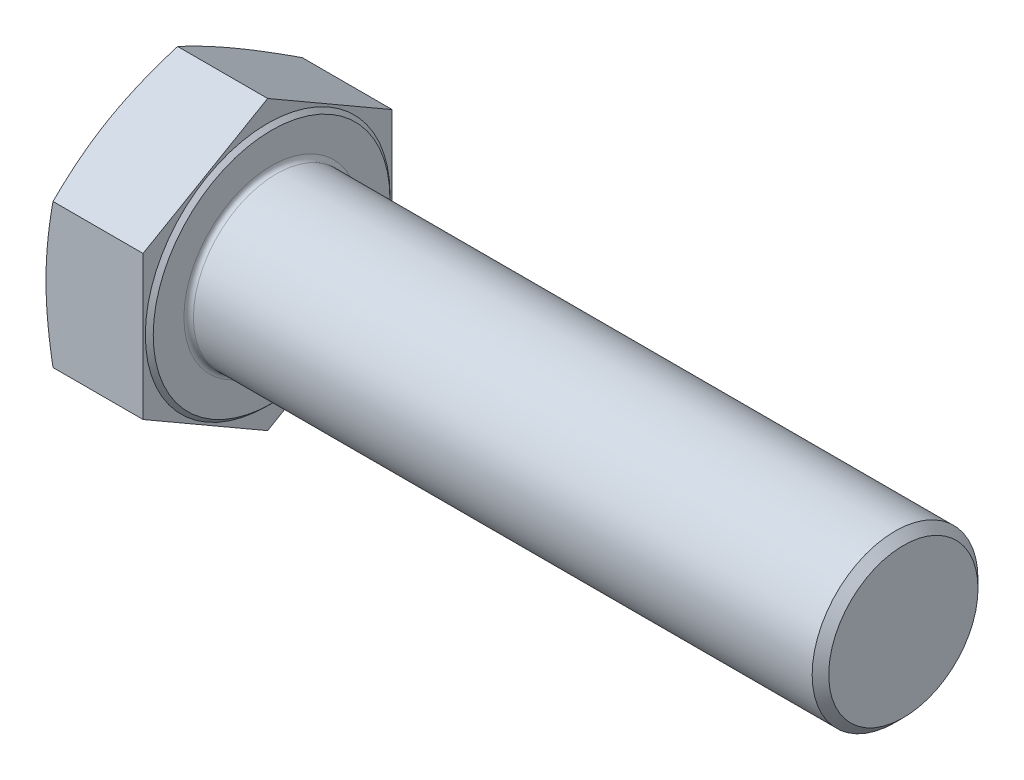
ISO-10303-21;
HEADER;
FILE_DESCRIPTION(('STEP AP214'),'2;1');
FILE_NAME('part.step','',(''),(''),'','','');
FILE_SCHEMA(('AUTOMOTIVE_DESIGN { 1 0 10303 214 1 1 1 1 }'));
ENDSEC;
DATA;
#1=APPLICATION_CONTEXT('core data for automotive mechanical design processes');
#2=APPLICATION_PROTOCOL_DEFINITION('international standard','automotive_design',2000,#1);
#3=PRODUCT_CONTEXT('',#1,'mechanical');
#4=PRODUCT('Part','Part','',(#3));
#5=PRODUCT_RELATED_PRODUCT_CATEGORY('part','',(#4));
#6=PRODUCT_DEFINITION_FORMATION('','',#4);
#7=PRODUCT_DEFINITION_CONTEXT('part definition',#1,'design');
#8=PRODUCT_DEFINITION('design','',#6,#7);
#9=PRODUCT_DEFINITION_SHAPE('','',#8);
#10=(LENGTH_UNIT() NAMED_UNIT(*) SI_UNIT(.MILLI.,.METRE.));
#11=(NAMED_UNIT(*) PLANE_ANGLE_UNIT() SI_UNIT($,.RADIAN.));
#12=(NAMED_UNIT(*) SI_UNIT($,.STERADIAN.) SOLID_ANGLE_UNIT());
#13=UNCERTAINTY_MEASURE_WITH_UNIT(LENGTH_MEASURE(1.E-05),#10,'distance_accuracy_value','');
#14=(GEOMETRIC_REPRESENTATION_CONTEXT(3) GLOBAL_UNCERTAINTY_ASSIGNED_CONTEXT((#13)) GLOBAL_UNIT_ASSIGNED_CONTEXT((#10,
#11,#12)) REPRESENTATION_CONTEXT('',''));
#15=CARTESIAN_POINT('',(0.,0.,0.));
#16=DIRECTION('',(0.,0.,1.));
#17=DIRECTION('',(1.,0.,0.));
#18=AXIS2_PLACEMENT_3D('',#15,#16,#17);
#19=CARTESIAN_POINT('',(25.58,-18.2154009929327,31.55));
#20=DIRECTION('',(-1.,0.,0.));
#21=DIRECTION('',(0.,0.,1.));
#22=AXIS2_PLACEMENT_3D('',#19,#20,#21);
#23=PLANE('',#22);
#24=CARTESIAN_POINT('',(25.58,0.,0.));
#25=DIRECTION('',(-1.,0.,0.));
#26=DIRECTION('',(0.,0.,1.));
#27=AXIS2_PLACEMENT_3D('',#24,#25,#26);
#28=CIRCLE('',#27,22.2);
#29=CARTESIAN_POINT('',(25.58,0.,22.2));
#30=VERTEX_POINT('',#29);
#31=EDGE_CURVE('E11',#30,#30,#28,.T.);
#32=ORIENTED_EDGE('',*,*,#31,.T.);
#33=EDGE_LOOP('',(#32));
#34=FACE_BOUND('',#33,.T.);
#35=CARTESIAN_POINT('',(25.58,0.,0.));
#36=DIRECTION('',(-1.,0.,0.));
#37=DIRECTION('',(0.,0.,1.));
#38=AXIS2_PLACEMENT_3D('',#35,#36,#37);
#39=CIRCLE('',#38,29.975);
#40=CARTESIAN_POINT('',(25.58,0.,29.975));
#41=VERTEX_POINT('',#40);
#42=EDGE_CURVE('E259',#41,#41,#39,.T.);
#43=ORIENTED_EDGE('',*,*,#42,.F.);
#44=EDGE_LOOP('',(#43));
#45=FACE_BOUND('',#44,.T.);
#46=ADVANCED_FACE('F32',(#34,#45),#23,.F.);
#47=CARTESIAN_POINT('',(25.58,-18.2154009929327,31.55));
#48=DIRECTION('',(0.,0.866025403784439,-0.5));
#49=DIRECTION('',(0.,0.5,0.866025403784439));
#50=AXIS2_PLACEMENT_3D('',#47,#48,#49);
#51=PLANE('',#50);
#52=CARTESIAN_POINT('',(1.77650867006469,-36.4309174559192,-0.00020000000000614));
#53=CARTESIAN_POINT('',(1.63921700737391,-36.0537041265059,0.653152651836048));
#54=CARTESIAN_POINT('',(1.50810383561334,-35.6759152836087,1.30750212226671));
#55=CARTESIAN_POINT('',(1.25958427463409,-34.9191773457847,2.61821067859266));
#56=CARTESIAN_POINT('',(1.14217918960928,-34.540228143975,3.27456994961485));
#57=CARTESIAN_POINT('',(0.922368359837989,-33.7809423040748,4.58969160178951));
#58=CARTESIAN_POINT('',(0.819974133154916,-33.400604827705,5.24845543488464));
#59=CARTESIAN_POINT('',(0.631651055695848,-32.6389184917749,6.56773486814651));
#60=CARTESIAN_POINT('',(0.54572174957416,-32.25756966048,7.22825041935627));
#61=CARTESIAN_POINT('',(0.392320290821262,-31.497572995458,8.54460325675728));
#62=CARTESIAN_POINT('',(0.32468174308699,-31.1189335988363,9.20042592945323));
#63=CARTESIAN_POINT('',(0.207877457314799,-30.3609372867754,10.5133140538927));
#64=CARTESIAN_POINT('',(0.158711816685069,-29.9815803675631,11.170379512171));
#65=CARTESIAN_POINT('',(0.079708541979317,-29.2224998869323,12.4851454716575));
#66=CARTESIAN_POINT('',(0.0498638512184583,-28.8427765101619,13.1428456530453));
#67=CARTESIAN_POINT('',(0.0100096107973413,-28.083069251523,14.4586972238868));
#68=CARTESIAN_POINT('',(0.,-27.703085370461,15.1168486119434));
#69=CARTESIAN_POINT('',(0.,-26.943117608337,16.4331513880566));
#70=CARTESIAN_POINT('',(0.0100096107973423,-26.563133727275,17.0913027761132));
#71=CARTESIAN_POINT('',(0.0498638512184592,-25.8034264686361,18.4071543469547));
#72=CARTESIAN_POINT('',(0.0797085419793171,-25.4237030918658,19.0648545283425));
#73=CARTESIAN_POINT('',(0.158711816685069,-24.6646226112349,20.3796204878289));
#74=CARTESIAN_POINT('',(0.2078774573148,-24.2852656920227,21.0366859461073));
#75=CARTESIAN_POINT('',(0.324681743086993,-23.5272693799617,22.3495740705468));
#76=CARTESIAN_POINT('',(0.392320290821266,-23.14862998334,23.0053967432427));
#77=CARTESIAN_POINT('',(0.545721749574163,-22.388633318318,24.3217495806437));
#78=CARTESIAN_POINT('',(0.631651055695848,-22.0072844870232,24.9822651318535));
#79=CARTESIAN_POINT('',(0.819974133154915,-21.2455981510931,26.3015445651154));
#80=CARTESIAN_POINT('',(0.92236835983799,-20.8652606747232,26.9603083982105));
#81=CARTESIAN_POINT('',(1.14217918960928,-20.1059748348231,28.2754300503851));
#82=CARTESIAN_POINT('',(1.25958427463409,-19.7270256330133,28.9317893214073));
#83=CARTESIAN_POINT('',(1.50810383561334,-18.9702876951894,30.2424978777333));
#84=CARTESIAN_POINT('',(1.63921700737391,-18.5924988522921,30.8968473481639));
#85=CARTESIAN_POINT('',(1.77650867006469,-18.2152855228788,31.5502));
#86=B_SPLINE_CURVE_WITH_KNOTS('',3,(#52,#53,#54,#55,#56,#57,#58,#59,#60,#61,#62,#63,#64,#65,#66,
#67,#68,#69,#70,#71,#72,#73,#74,#75,#76,#77,#78,#79,#80,#81,#82,#83,#84,#85),.UNSPECIFIED.,.F.,
.F.,(4,2,2,2,2,2,2,2,2,2,2,2,2,2,2,2,4),(0.,2.30046481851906,4.60114832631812,6.90358804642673,
9.20596408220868,11.4866307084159,13.7673093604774,16.0471545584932,18.3269927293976,
20.606830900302,22.8866760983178,25.1673547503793,27.4480213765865,29.7503974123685,
32.0528371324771,34.3535206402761,36.6539854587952),.UNSPECIFIED.);
#87=CARTESIAN_POINT('',(1.77646664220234,-36.4308019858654,0.));
#88=VERTEX_POINT('',#87);
#89=CARTESIAN_POINT('',(0.,-27.323101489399,15.775));
#90=VERTEX_POINT('',#89);
#91=EDGE_CURVE('E278',#88,#90,#86,.T.);
#92=ORIENTED_EDGE('',*,*,#91,.F.);
#93=DIRECTION('',(-1.,0.,0.));
#94=VECTOR('',#93,1.);
#95=CARTESIAN_POINT('',(25.58,-36.4308019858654,0.));
#96=LINE('',#95,#94);
#97=CARTESIAN_POINT('',(24.58,-36.4308019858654,0.));
#98=VERTEX_POINT('',#97);
#99=EDGE_CURVE('E144',#98,#88,#96,.T.);
#100=ORIENTED_EDGE('',*,*,#99,.F.);
#101=DIRECTION('',(0.,-0.5,-0.866025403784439));
#102=VECTOR('',#101,1.);
#103=CARTESIAN_POINT('',(24.58,-18.2154009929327,31.55));
#104=LINE('',#103,#102);
#105=CARTESIAN_POINT('',(24.58,-18.2154009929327,31.55));
#106=VERTEX_POINT('',#105);
#107=EDGE_CURVE('E135',#106,#98,#104,.T.);
#108=ORIENTED_EDGE('',*,*,#107,.F.);
#109=DIRECTION('',(-1.,0.,0.));
#110=VECTOR('',#109,1.);
#111=CARTESIAN_POINT('',(25.58,-18.2154009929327,31.55));
#112=LINE('',#111,#110);
#113=CARTESIAN_POINT('',(1.77646664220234,-18.2154009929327,31.55));
#114=VERTEX_POINT('',#113);
#115=EDGE_CURVE('E130',#106,#114,#112,.T.);
#116=ORIENTED_EDGE('',*,*,#115,.T.);
#117=EDGE_CURVE('E124',#90,#114,#86,.T.);
#118=ORIENTED_EDGE('',*,*,#117,.F.);
#119=EDGE_LOOP('',(#92,#100,#108,#116,#118));
#120=FACE_BOUND('',#119,.T.);
#121=ADVANCED_FACE('F34',(#120),#51,.F.);
#122=CARTESIAN_POINT('',(25.58,-36.4308019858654,0.));
#123=DIRECTION('',(0.,0.866025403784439,0.5));
#124=DIRECTION('',(0.,-0.5,0.866025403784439));
#125=AXIS2_PLACEMENT_3D('',#122,#123,#124);
#126=PLANE('',#125);
#127=CARTESIAN_POINT('',(1.7765086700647,-18.2152855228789,-31.5502));
#128=CARTESIAN_POINT('',(1.63921700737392,-18.5924988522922,-30.8968473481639));
#129=CARTESIAN_POINT('',(1.50810383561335,-18.9702876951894,-30.2424978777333));
#130=CARTESIAN_POINT('',(1.25958427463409,-19.7270256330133,-28.9317893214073));
#131=CARTESIAN_POINT('',(1.14217918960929,-20.1059748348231,-28.2754300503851));
#132=CARTESIAN_POINT('',(0.922368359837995,-20.8652606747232,-26.9603083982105));
#133=CARTESIAN_POINT('',(0.819974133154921,-21.2455981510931,-26.3015445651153));
#134=CARTESIAN_POINT('',(0.631651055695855,-22.0072844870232,-24.9822651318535));
#135=CARTESIAN_POINT('',(0.545721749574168,-22.3886333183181,-24.3217495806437));
#136=CARTESIAN_POINT('',(0.39232029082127,-23.1486299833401,-23.0053967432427));
#137=CARTESIAN_POINT('',(0.324681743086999,-23.5272693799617,-22.3495740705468));
#138=CARTESIAN_POINT('',(0.207877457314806,-24.2852656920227,-21.0366859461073));
#139=CARTESIAN_POINT('',(0.158711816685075,-24.6646226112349,-20.3796204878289));
#140=CARTESIAN_POINT('',(0.0797085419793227,-25.4237030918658,-19.0648545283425));
#141=CARTESIAN_POINT('',(0.0498638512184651,-25.8034264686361,-18.4071543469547));
#142=CARTESIAN_POINT('',(0.0100096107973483,-26.563133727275,-17.0913027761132));
#143=CARTESIAN_POINT('',(0.,-26.943117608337,-16.4331513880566));
#144=CARTESIAN_POINT('',(0.,-27.7030853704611,-15.1168486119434));
#145=CARTESIAN_POINT('',(0.010009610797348,-28.0830692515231,-14.4586972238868));
#146=CARTESIAN_POINT('',(0.0498638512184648,-28.842776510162,-13.1428456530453));
#147=CARTESIAN_POINT('',(0.0797085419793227,-29.2224998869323,-12.4851454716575));
#148=CARTESIAN_POINT('',(0.158711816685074,-29.9815803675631,-11.1703795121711));
#149=CARTESIAN_POINT('',(0.207877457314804,-30.3609372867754,-10.5133140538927));
#150=CARTESIAN_POINT('',(0.324681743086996,-31.1189335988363,-9.20042592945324));
#151=CARTESIAN_POINT('',(0.392320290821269,-31.497572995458,-8.54460325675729));
#152=CARTESIAN_POINT('',(0.545721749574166,-32.25756966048,-7.22825041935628));
#153=CARTESIAN_POINT('',(0.631651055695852,-32.6389184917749,-6.56773486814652));
#154=CARTESIAN_POINT('',(0.819974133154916,-33.400604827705,-5.24845543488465));
#155=CARTESIAN_POINT('',(0.92236835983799,-33.7809423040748,-4.58969160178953));
#156=CARTESIAN_POINT('',(1.14217918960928,-34.540228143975,-3.27456994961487));
#157=CARTESIAN_POINT('',(1.25958427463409,-34.9191773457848,-2.61821067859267));
#158=CARTESIAN_POINT('',(1.50810383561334,-35.6759152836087,-1.30750212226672));
#159=CARTESIAN_POINT('',(1.63921700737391,-36.0537041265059,-0.653152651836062));
#160=CARTESIAN_POINT('',(1.77650867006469,-36.4309174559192,0.000199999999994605));
#161=B_SPLINE_CURVE_WITH_KNOTS('',3,(#127,#128,#129,#130,#131,#132,#133,#134,#135,#136,#137,
#138,#139,#140,#141,#142,#143,#144,#145,#146,#147,#148,#149,#150,#151,#152,#153,#154,#155,#156,
#157,#158,#159,#160),.UNSPECIFIED.,.F.,.F.,(4,2,2,2,2,2,2,2,2,2,2,2,2,2,2,2,4),(0.,
2.30046481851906,4.60114832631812,6.90358804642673,9.20596408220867,11.4866307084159,
13.7673093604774,16.0471545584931,18.3269927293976,20.606830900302,22.8866760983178,
25.1673547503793,27.4480213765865,29.7503974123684,32.0528371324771,34.3535206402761,
36.6539854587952),.UNSPECIFIED.);
#162=CARTESIAN_POINT('',(1.77646664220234,-18.2154009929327,-31.55));
#163=VERTEX_POINT('',#162);
#164=CARTESIAN_POINT('',(0.,-27.323101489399,-15.775));
#165=VERTEX_POINT('',#164);
#166=EDGE_CURVE('E230',#163,#165,#161,.T.);
#167=ORIENTED_EDGE('',*,*,#166,.F.);
#168=DIRECTION('',(-1.,0.,0.));
#169=VECTOR('',#168,1.);
#170=CARTESIAN_POINT('',(25.58,-18.2154009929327,-31.55));
#171=LINE('',#170,#169);
#172=CARTESIAN_POINT('',(24.58,-18.2154009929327,-31.55));
#173=VERTEX_POINT('',#172);
#174=EDGE_CURVE('E141',#173,#163,#171,.T.);
#175=ORIENTED_EDGE('',*,*,#174,.F.);
#176=DIRECTION('',(0.,0.5,-0.866025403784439));
#177=VECTOR('',#176,1.);
#178=CARTESIAN_POINT('',(24.58,-36.4308019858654,0.));
#179=LINE('',#178,#177);
#180=EDGE_CURVE('E268',#98,#173,#179,.T.);
#181=ORIENTED_EDGE('',*,*,#180,.F.);
#182=ORIENTED_EDGE('',*,*,#99,.T.);
#183=EDGE_CURVE('E226',#165,#88,#161,.T.);
#184=ORIENTED_EDGE('',*,*,#183,.F.);
#185=EDGE_LOOP('',(#167,#175,#181,#182,#184));
#186=FACE_BOUND('',#185,.T.);
#187=ADVANCED_FACE('F180',(#186),#126,.F.);
#188=CARTESIAN_POINT('',(25.58,-18.2154009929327,-31.55));
#189=DIRECTION('',(0.,0.,1.));
#190=DIRECTION('',(1.,0.,0.));
#191=AXIS2_PLACEMENT_3D('',#188,#189,#190);
#192=PLANE('',#191);
#193=CARTESIAN_POINT('',(9.49273322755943,-48.2279768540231,-31.55));
#194=CARTESIAN_POINT('',(9.27535533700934,-47.514269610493,-31.55));
#195=CARTESIAN_POINT('',(9.05928889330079,-46.800161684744,-31.55));
#196=CARTESIAN_POINT('',(8.63007953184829,-45.3710634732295,-31.55));
#197=CARTESIAN_POINT('',(8.41693663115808,-44.6560731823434,-31.55));
#198=CARTESIAN_POINT('',(7.99386108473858,-43.2250819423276,-31.55));
#199=CARTESIAN_POINT('',(7.78392868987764,-42.5090809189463,-31.55));
#200=CARTESIAN_POINT('',(7.36764737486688,-41.076039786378,-31.55));
#201=CARTESIAN_POINT('',(7.16129844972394,-40.3589996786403,-31.55));
#202=CARTESIAN_POINT('',(6.54743934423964,-38.2035017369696,-31.55));
#203=CARTESIAN_POINT('',(6.14590801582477,-36.7633320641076,-31.55));
#204=CARTESIAN_POINT('',(5.36259762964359,-33.8776407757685,-31.55));
#205=CARTESIAN_POINT('',(4.98081821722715,-32.4321192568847,-31.55));
#206=CARTESIAN_POINT('',(4.24647492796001,-29.5526164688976,-31.55));
#207=CARTESIAN_POINT('',(3.89360887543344,-28.1187126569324,-31.55));
#208=CARTESIAN_POINT('',(3.21791822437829,-25.2437711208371,-31.55));
#209=CARTESIAN_POINT('',(2.89509413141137,-23.8027332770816,-31.55));
#210=CARTESIAN_POINT('',(2.28701543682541,-20.9131959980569,-31.55));
#211=CARTESIAN_POINT('',(2.00174801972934,-19.4646992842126,-31.55));
#212=CARTESIAN_POINT('',(1.47746597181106,-16.5593103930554,-31.55));
#213=CARTESIAN_POINT('',(1.23844979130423,-15.1024184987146,-31.55));
#214=CARTESIAN_POINT('',(0.840056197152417,-12.3442275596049,-31.55));
#215=CARTESIAN_POINT('',(0.674754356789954,-11.0437977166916,-31.55));
#216=CARTESIAN_POINT('',(0.464868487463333,-9.08909899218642,-31.55));
#217=CARTESIAN_POINT('',(0.401250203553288,-8.43684521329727,-31.55));
#218=CARTESIAN_POINT('',(0.287418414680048,-7.13117503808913,-31.55));
#219=CARTESIAN_POINT('',(0.237204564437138,-6.47775867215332,-31.55));
#220=CARTESIAN_POINT('',(0.150830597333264,-5.17044631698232,-31.55));
#221=CARTESIAN_POINT('',(0.114660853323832,-4.5165509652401,-31.55));
#222=CARTESIAN_POINT('',(0.0567933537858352,-3.20811756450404,-31.55));
#223=CARTESIAN_POINT('',(0.035095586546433,-2.55357951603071,-31.55));
#224=CARTESIAN_POINT('',(0.00646379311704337,-1.24418168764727,-31.55));
#225=CARTESIAN_POINT('',(-0.000470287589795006,-0.589321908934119,-31.55));
#226=CARTESIAN_POINT('',(0.000519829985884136,0.720386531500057,-31.55));
#227=CARTESIAN_POINT('',(0.00844403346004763,1.37523519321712,-31.55));
#228=CARTESIAN_POINT('',(0.0391201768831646,2.68790470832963,-31.55));
#229=CARTESIAN_POINT('',(0.0619470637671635,3.34572380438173,-31.55));
#230=CARTESIAN_POINT('',(0.122191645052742,4.66069052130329,-31.55));
#231=CARTESIAN_POINT('',(0.159609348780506,5.31783814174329,-31.55));
#232=CARTESIAN_POINT('',(0.248549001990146,6.63117728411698,-31.55));
#233=CARTESIAN_POINT('',(0.300070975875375,7.28736880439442,-31.55));
#234=CARTESIAN_POINT('',(0.416580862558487,8.59856130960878,-31.55));
#235=CARTESIAN_POINT('',(0.481569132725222,9.25356226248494,-31.55));
#236=CARTESIAN_POINT('',(0.695749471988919,11.2175532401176,-31.55));
#237=CARTESIAN_POINT('',(0.864084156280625,12.5244870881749,-31.55));
#238=CARTESIAN_POINT('',(1.24501148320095,15.1317721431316,-31.55));
#239=CARTESIAN_POINT('',(1.4576043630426,16.4321233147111,-31.55));
#240=CARTESIAN_POINT('',(1.93235405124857,19.0947258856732,-31.55));
#241=CARTESIAN_POINT('',(2.19653772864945,20.456613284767,-31.55));
#242=CARTESIAN_POINT('',(2.7589076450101,23.173391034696,-31.55));
#243=CARTESIAN_POINT('',(3.05709644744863,24.5282808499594,-31.55));
#244=CARTESIAN_POINT('',(3.68121461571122,27.2320333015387,-31.55));
#245=CARTESIAN_POINT('',(4.00715203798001,28.5808940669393,-31.55));
#246=CARTESIAN_POINT('',(4.68146557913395,31.2729332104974,-31.55));
#247=CARTESIAN_POINT('',(5.02984116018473,32.6161117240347,-31.55));
#248=CARTESIAN_POINT('',(5.74529589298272,35.2993081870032,-31.55));
#249=CARTESIAN_POINT('',(6.11239849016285,36.6393198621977,-31.55));
#250=CARTESIAN_POINT('',(6.86153703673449,39.3151567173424,-31.55));
#251=CARTESIAN_POINT('',(7.24357304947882,40.6509818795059,-31.55));
#252=CARTESIAN_POINT('',(8.01984512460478,43.3188318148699,-31.55));
#253=CARTESIAN_POINT('',(8.41407912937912,44.6508571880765,-31.55));
#254=CARTESIAN_POINT('',(9.21268883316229,47.3118560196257,-31.55));
#255=CARTESIAN_POINT('',(9.61706451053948,48.6408294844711,-31.55));
#256=CARTESIAN_POINT('',(10.4297571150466,51.2815133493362,-31.55));
#257=CARTESIAN_POINT('',(10.8379812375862,52.5932523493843,-31.55));
#258=CARTESIAN_POINT('',(11.6613832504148,55.2145439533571,-31.55));
#259=CARTESIAN_POINT('',(12.0765611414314,56.524096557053,-31.55));
#260=CARTESIAN_POINT('',(12.9128263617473,59.1413781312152,-31.55));
#261=CARTESIAN_POINT('',(13.3339139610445,60.4491070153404,-31.55));
#262=CARTESIAN_POINT('',(14.1811137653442,63.0629364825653,-31.55));
#263=CARTESIAN_POINT('',(14.6072259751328,64.3690370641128,-31.55));
#264=CARTESIAN_POINT('',(15.462137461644,66.974867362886,-31.55));
#265=CARTESIAN_POINT('',(15.8909203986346,68.2746024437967,-31.55));
#266=CARTESIAN_POINT('',(16.7521863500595,70.8728463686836,-31.55));
#267=CARTESIAN_POINT('',(17.184669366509,72.1713552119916,-31.55));
#268=CARTESIAN_POINT('',(18.0528122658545,74.7671917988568,-31.55));
#269=CARTESIAN_POINT('',(18.4884718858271,76.0645196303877,-31.55));
#270=CARTESIAN_POINT('',(19.3626101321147,78.6582218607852,-31.55));
#271=CARTESIAN_POINT('',(19.8010887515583,79.9545962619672,-31.55));
#272=CARTESIAN_POINT('',(20.2407815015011,81.2505577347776,-31.55));
#273=B_SPLINE_CURVE_WITH_KNOTS('',3,(#193,#194,#195,#196,#197,#198,#199,#200,#201,#202,#203,
#204,#205,#206,#207,#208,#209,#210,#211,#212,#213,#214,#215,#216,#217,#218,#219,#220,#221,#222,
#223,#224,#225,#226,#227,#228,#229,#230,#231,#232,#233,#234,#235,#236,#237,#238,#239,#240,#241,
#242,#243,#244,#245,#246,#247,#248,#249,#250,#251,#252,#253,#254,#255,#256,#257,#258,#259,#260,
#261,#262,#263,#264,#265,#266,#267,#268,#269,#270,#271,#272),.UNSPECIFIED.,.F.,.F.,(4,2,2,2,2,2,
2,2,2,2,2,2,2,2,2,2,2,2,2,2,2,2,2,2,2,2,2,2,2,2,2,2,2,2,2,2,2,2,2,4),(0.,2.23823199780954,
4.47647704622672,6.71489610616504,8.95331204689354,13.4384856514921,17.9235786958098,
22.3533728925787,26.7832416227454,31.2115948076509,35.6397995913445,39.5715182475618,
41.5374489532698,43.5033290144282,45.4678590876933,47.4323875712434,49.3969088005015,
51.3614307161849,53.3359092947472,55.310389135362,57.2848723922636,59.2594080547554,
63.2116176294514,67.1638483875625,71.3251316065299,75.4867287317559,79.649538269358,
83.8122480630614,87.9803038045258,92.1483772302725,96.3157513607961,100.483116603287,
104.604471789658,108.725827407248,112.847371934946,116.968920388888,121.07482378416,
125.180729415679,129.286298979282,133.391858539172),.UNSPECIFIED.);
#274=CARTESIAN_POINT('',(1.77646664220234,18.2154009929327,-31.55));
#275=VERTEX_POINT('',#274);
#276=CARTESIAN_POINT('',(0.,0.,-31.55));
#277=VERTEX_POINT('',#276);
#278=EDGE_CURVE('E304',#275,#277,#273,.F.);
#279=ORIENTED_EDGE('',*,*,#278,.F.);
#280=DIRECTION('',(-1.,0.,0.));
#281=VECTOR('',#280,1.);
#282=CARTESIAN_POINT('',(25.58,18.2154009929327,-31.55));
#283=LINE('',#282,#281);
#284=CARTESIAN_POINT('',(24.58,18.2154009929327,-31.55));
#285=VERTEX_POINT('',#284);
#286=EDGE_CURVE('E132',#285,#275,#283,.T.);
#287=ORIENTED_EDGE('',*,*,#286,.F.);
#288=DIRECTION('',(0.,1.,0.));
#289=VECTOR('',#288,1.);
#290=CARTESIAN_POINT('',(24.58,-18.2154009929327,-31.55));
#291=LINE('',#290,#289);
#292=EDGE_CURVE('E261',#173,#285,#291,.T.);
#293=ORIENTED_EDGE('',*,*,#292,.F.);
#294=ORIENTED_EDGE('',*,*,#174,.T.);
#295=EDGE_CURVE('E231',#277,#163,#273,.F.);
#296=ORIENTED_EDGE('',*,*,#295,.F.);
#297=EDGE_LOOP('',(#279,#287,#293,#294,#296));
#298=FACE_BOUND('',#297,.T.);
#299=ADVANCED_FACE('F239',(#298),#192,.F.);
#300=CARTESIAN_POINT('',(25.58,18.2154009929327,-31.55));
#301=DIRECTION('',(0.,-0.866025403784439,0.5));
#302=DIRECTION('',(0.,-0.5,-0.866025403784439));
#303=AXIS2_PLACEMENT_3D('',#300,#301,#302);
#304=PLANE('',#303);
#305=CARTESIAN_POINT('',(1.7765086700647,36.4309174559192,0.000199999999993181));
#306=CARTESIAN_POINT('',(1.63921700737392,36.0537041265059,-0.653152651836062));
#307=CARTESIAN_POINT('',(1.50810383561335,35.6759152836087,-1.30750212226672));
#308=CARTESIAN_POINT('',(1.2595842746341,34.9191773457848,-2.61821067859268));
#309=CARTESIAN_POINT('',(1.14217918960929,34.540228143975,-3.27456994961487));
#310=CARTESIAN_POINT('',(0.922368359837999,33.7809423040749,-4.58969160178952));
#311=CARTESIAN_POINT('',(0.819974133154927,33.400604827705,-5.24845543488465));
#312=CARTESIAN_POINT('',(0.631651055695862,32.6389184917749,-6.56773486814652));
#313=CARTESIAN_POINT('',(0.545721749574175,32.25756966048,-7.22825041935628));
#314=CARTESIAN_POINT('',(0.392320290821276,31.497572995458,-8.54460325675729));
#315=CARTESIAN_POINT('',(0.324681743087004,31.1189335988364,-9.20042592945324));
#316=CARTESIAN_POINT('',(0.207877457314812,30.3609372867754,-10.5133140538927));
#317=CARTESIAN_POINT('',(0.158711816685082,29.9815803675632,-11.1703795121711));
#318=CARTESIAN_POINT('',(0.0797085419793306,29.2224998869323,-12.4851454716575));
#319=CARTESIAN_POINT('',(0.0498638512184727,28.842776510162,-13.1428456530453));
#320=CARTESIAN_POINT('',(0.0100096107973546,28.0830692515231,-14.4586972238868));
#321=CARTESIAN_POINT('',(0.,27.7030853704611,-15.1168486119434));
#322=CARTESIAN_POINT('',(0.,26.943117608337,-16.4331513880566));
#323=CARTESIAN_POINT('',(0.0100096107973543,26.563133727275,-17.0913027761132));
#324=CARTESIAN_POINT('',(0.0498638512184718,25.8034264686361,-18.4071543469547));
#325=CARTESIAN_POINT('',(0.0797085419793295,25.4237030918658,-19.0648545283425));
#326=CARTESIAN_POINT('',(0.15871181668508,24.664622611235,-20.3796204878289));
#327=CARTESIAN_POINT('',(0.207877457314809,24.2852656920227,-21.0366859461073));
#328=CARTESIAN_POINT('',(0.324681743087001,23.5272693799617,-22.3495740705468));
#329=CARTESIAN_POINT('',(0.392320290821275,23.1486299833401,-23.0053967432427));
#330=CARTESIAN_POINT('',(0.545721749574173,22.3886333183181,-24.3217495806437));
#331=CARTESIAN_POINT('',(0.63165105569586,22.0072844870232,-24.9822651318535));
#332=CARTESIAN_POINT('',(0.819974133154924,21.2455981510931,-26.3015445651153));
#333=CARTESIAN_POINT('',(0.922368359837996,20.8652606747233,-26.9603083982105));
#334=CARTESIAN_POINT('',(1.14217918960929,20.1059748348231,-28.2754300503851));
#335=CARTESIAN_POINT('',(1.25958427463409,19.7270256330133,-28.9317893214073));
#336=CARTESIAN_POINT('',(1.50810383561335,18.9702876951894,-30.2424978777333));
#337=CARTESIAN_POINT('',(1.63921700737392,18.5924988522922,-30.8968473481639));
#338=CARTESIAN_POINT('',(1.7765086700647,18.2152855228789,-31.5502));
#339=B_SPLINE_CURVE_WITH_KNOTS('',3,(#305,#306,#307,#308,#309,#310,#311,#312,#313,#314,#315,
#316,#317,#318,#319,#320,#321,#322,#323,#324,#325,#326,#327,#328,#329,#330,#331,#332,#333,#334,
#335,#336,#337,#338),.UNSPECIFIED.,.F.,.F.,(4,2,2,2,2,2,2,2,2,2,2,2,2,2,2,2,4),(0.,
2.30046481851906,4.60114832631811,6.90358804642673,9.20596408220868,11.4866307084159,
13.7673093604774,16.0471545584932,18.3269927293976,20.606830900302,22.8866760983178,
25.1673547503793,27.4480213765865,29.7503974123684,32.0528371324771,34.3535206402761,
36.6539854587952),.UNSPECIFIED.);
#340=CARTESIAN_POINT('',(1.77646664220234,36.4308019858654,0.));
#341=VERTEX_POINT('',#340);
#342=CARTESIAN_POINT('',(0.,27.323101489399,-15.775));
#343=VERTEX_POINT('',#342);
#344=EDGE_CURVE('E221',#341,#343,#339,.T.);
#345=ORIENTED_EDGE('',*,*,#344,.F.);
#346=DIRECTION('',(-1.,0.,0.));
#347=VECTOR('',#346,1.);
#348=CARTESIAN_POINT('',(25.58,36.4308019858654,0.));
#349=LINE('',#348,#347);
#350=CARTESIAN_POINT('',(24.58,36.4308019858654,0.));
#351=VERTEX_POINT('',#350);
#352=EDGE_CURVE('E129',#351,#341,#349,.T.);
#353=ORIENTED_EDGE('',*,*,#352,.F.);
#354=DIRECTION('',(0.,0.5,0.866025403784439));
#355=VECTOR('',#354,1.);
#356=CARTESIAN_POINT('',(24.58,18.2154009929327,-31.55));
#357=LINE('',#356,#355);
#358=EDGE_CURVE('E258',#285,#351,#357,.T.);
#359=ORIENTED_EDGE('',*,*,#358,.F.);
#360=ORIENTED_EDGE('',*,*,#286,.T.);
#361=EDGE_CURVE('E255',#343,#275,#339,.T.);
#362=ORIENTED_EDGE('',*,*,#361,.F.);
#363=EDGE_LOOP('',(#345,#353,#359,#360,#362));
#364=FACE_BOUND('',#363,.T.);
#365=ADVANCED_FACE('F243',(#364),#304,.F.);
#366=CARTESIAN_POINT('',(25.58,36.4308019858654,0.));
#367=DIRECTION('',(0.,-0.866025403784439,-0.5));
#368=DIRECTION('',(0.,0.5,-0.866025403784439));
#369=AXIS2_PLACEMENT_3D('',#366,#367,#368);
#370=PLANE('',#369);
#371=CARTESIAN_POINT('',(1.7765086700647,18.2152855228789,31.5502));
#372=CARTESIAN_POINT('',(1.63921700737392,18.5924988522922,30.8968473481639));
#373=CARTESIAN_POINT('',(1.50810383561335,18.9702876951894,30.2424978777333));
#374=CARTESIAN_POINT('',(1.2595842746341,19.7270256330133,28.9317893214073));
#375=CARTESIAN_POINT('',(1.14217918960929,20.1059748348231,28.2754300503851));
#376=CARTESIAN_POINT('',(0.922368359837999,20.8652606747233,26.9603083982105));
#377=CARTESIAN_POINT('',(0.819974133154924,21.2455981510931,26.3015445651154));
#378=CARTESIAN_POINT('',(0.631651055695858,22.0072844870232,24.9822651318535));
#379=CARTESIAN_POINT('',(0.545721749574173,22.3886333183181,24.3217495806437));
#380=CARTESIAN_POINT('',(0.392320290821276,23.1486299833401,23.0053967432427));
#381=CARTESIAN_POINT('',(0.324681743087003,23.5272693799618,22.3495740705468));
#382=CARTESIAN_POINT('',(0.207877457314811,24.2852656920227,21.0366859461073));
#383=CARTESIAN_POINT('',(0.15871181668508,24.664622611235,20.3796204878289));
#384=CARTESIAN_POINT('',(0.0797085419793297,25.4237030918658,19.0648545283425));
#385=CARTESIAN_POINT('',(0.0498638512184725,25.8034264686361,18.4071543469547));
#386=CARTESIAN_POINT('',(0.0100096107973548,26.563133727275,17.0913027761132));
#387=CARTESIAN_POINT('',(0.,26.943117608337,16.4331513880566));
#388=CARTESIAN_POINT('',(0.,27.7030853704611,15.1168486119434));
#389=CARTESIAN_POINT('',(0.0100096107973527,28.0830692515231,14.4586972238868));
#390=CARTESIAN_POINT('',(0.0498638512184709,28.842776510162,13.1428456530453));
#391=CARTESIAN_POINT('',(0.0797085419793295,29.2224998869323,12.4851454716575));
#392=CARTESIAN_POINT('',(0.158711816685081,29.9815803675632,11.170379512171));
#393=CARTESIAN_POINT('',(0.20787745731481,30.3609372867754,10.5133140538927));
#394=CARTESIAN_POINT('',(0.324681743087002,31.1189335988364,9.20042592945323));
#395=CARTESIAN_POINT('',(0.392320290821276,31.497572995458,8.54460325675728));
#396=CARTESIAN_POINT('',(0.545721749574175,32.25756966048,7.22825041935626));
#397=CARTESIAN_POINT('',(0.631651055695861,32.6389184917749,6.56773486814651));
#398=CARTESIAN_POINT('',(0.819974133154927,33.400604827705,5.24845543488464));
#399=CARTESIAN_POINT('',(0.922368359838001,33.7809423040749,4.58969160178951));
#400=CARTESIAN_POINT('',(1.14217918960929,34.540228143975,3.27456994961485));
#401=CARTESIAN_POINT('',(1.2595842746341,34.9191773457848,2.61821067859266));
#402=CARTESIAN_POINT('',(1.50810383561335,35.6759152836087,1.3075021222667));
#403=CARTESIAN_POINT('',(1.63921700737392,36.0537041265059,0.653152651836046));
#404=CARTESIAN_POINT('',(1.7765086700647,36.4309174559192,-0.000200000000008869));
#405=B_SPLINE_CURVE_WITH_KNOTS('',3,(#371,#372,#373,#374,#375,#376,#377,#378,#379,#380,#381,
#382,#383,#384,#385,#386,#387,#388,#389,#390,#391,#392,#393,#394,#395,#396,#397,#398,#399,#400,
#401,#402,#403,#404),.UNSPECIFIED.,.F.,.F.,(4,2,2,2,2,2,2,2,2,2,2,2,2,2,2,2,4),(0.,
2.30046481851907,4.60114832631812,6.90358804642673,9.20596408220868,11.4866307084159,
13.7673093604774,16.0471545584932,18.3269927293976,20.606830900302,22.8866760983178,
25.1673547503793,27.4480213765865,29.7503974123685,32.0528371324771,34.3535206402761,
36.6539854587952),.UNSPECIFIED.);
#406=CARTESIAN_POINT('',(1.77646664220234,18.2154009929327,31.55));
#407=VERTEX_POINT('',#406);
#408=CARTESIAN_POINT('',(0.,27.323101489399,15.775));
#409=VERTEX_POINT('',#408);
#410=EDGE_CURVE('E109',#407,#409,#405,.T.);
#411=ORIENTED_EDGE('',*,*,#410,.F.);
#412=DIRECTION('',(-1.,0.,0.));
#413=VECTOR('',#412,1.);
#414=CARTESIAN_POINT('',(25.58,18.2154009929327,31.55));
#415=LINE('',#414,#413);
#416=CARTESIAN_POINT('',(24.58,18.2154009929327,31.55));
#417=VERTEX_POINT('',#416);
#418=EDGE_CURVE('E121',#417,#407,#415,.T.);
#419=ORIENTED_EDGE('',*,*,#418,.F.);
#420=DIRECTION('',(0.,-0.5,0.866025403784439));
#421=VECTOR('',#420,1.);
#422=CARTESIAN_POINT('',(24.58,36.4308019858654,0.));
#423=LINE('',#422,#421);
#424=EDGE_CURVE('E56',#351,#417,#423,.T.);
#425=ORIENTED_EDGE('',*,*,#424,.F.);
#426=ORIENTED_EDGE('',*,*,#352,.T.);
#427=EDGE_CURVE('E123',#409,#341,#405,.T.);
#428=ORIENTED_EDGE('',*,*,#427,.F.);
#429=EDGE_LOOP('',(#411,#419,#425,#426,#428));
#430=FACE_BOUND('',#429,.T.);
#431=ADVANCED_FACE('F120',(#430),#370,.F.);
#432=CARTESIAN_POINT('',(25.58,18.2154009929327,31.55));
#433=DIRECTION('',(0.,0.,-1.));
#434=DIRECTION('',(-1.,0.,0.));
#435=AXIS2_PLACEMENT_3D('',#432,#433,#434);
#436=PLANE('',#435);
#437=CARTESIAN_POINT('',(9.49273322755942,-48.2279768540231,31.55));
#438=CARTESIAN_POINT('',(9.27535533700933,-47.5142696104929,31.55));
#439=CARTESIAN_POINT('',(9.05928889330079,-46.800161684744,31.55));
#440=CARTESIAN_POINT('',(8.63007953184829,-45.3710634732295,31.55));
#441=CARTESIAN_POINT('',(8.41693663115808,-44.6560731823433,31.55));
#442=CARTESIAN_POINT('',(7.99386108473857,-43.2250819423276,31.55));
#443=CARTESIAN_POINT('',(7.78392868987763,-42.5090809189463,31.55));
#444=CARTESIAN_POINT('',(7.36764737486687,-41.076039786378,31.55));
#445=CARTESIAN_POINT('',(7.16129844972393,-40.3589996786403,31.55));
#446=CARTESIAN_POINT('',(6.54743934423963,-38.2035017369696,31.55));
#447=CARTESIAN_POINT('',(6.14590801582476,-36.7633320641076,31.55));
#448=CARTESIAN_POINT('',(5.36259762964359,-33.8776407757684,31.55));
#449=CARTESIAN_POINT('',(4.98081821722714,-32.4321192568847,31.55));
#450=CARTESIAN_POINT('',(4.24647492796,-29.5526164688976,31.55));
#451=CARTESIAN_POINT('',(3.89360887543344,-28.1187126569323,31.55));
#452=CARTESIAN_POINT('',(3.21791822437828,-25.2437711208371,31.55));
#453=CARTESIAN_POINT('',(2.89509413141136,-23.8027332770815,31.55));
#454=CARTESIAN_POINT('',(2.28701543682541,-20.9131959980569,31.55));
#455=CARTESIAN_POINT('',(2.00174801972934,-19.4646992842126,31.55));
#456=CARTESIAN_POINT('',(1.47746597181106,-16.5593103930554,31.55));
#457=CARTESIAN_POINT('',(1.23844979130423,-15.1024184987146,31.55));
#458=CARTESIAN_POINT('',(0.840056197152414,-12.3442275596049,31.55));
#459=CARTESIAN_POINT('',(0.674754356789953,-11.0437977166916,31.55));
#460=CARTESIAN_POINT('',(0.464868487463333,-9.0890989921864,31.55));
#461=CARTESIAN_POINT('',(0.401250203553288,-8.43684521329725,31.55));
#462=CARTESIAN_POINT('',(0.287418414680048,-7.13117503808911,31.55));
#463=CARTESIAN_POINT('',(0.237204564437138,-6.4777586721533,31.55));
#464=CARTESIAN_POINT('',(0.150830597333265,-5.1704463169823,31.55));
#465=CARTESIAN_POINT('',(0.114660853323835,-4.51655096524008,31.55));
#466=CARTESIAN_POINT('',(0.0567933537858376,-3.20811756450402,31.55));
#467=CARTESIAN_POINT('',(0.0350955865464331,-2.55357951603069,31.55));
#468=CARTESIAN_POINT('',(0.00646379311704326,-1.24418168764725,31.55));
#469=CARTESIAN_POINT('',(-0.000470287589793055,-0.589321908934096,31.55));
#470=CARTESIAN_POINT('',(0.000519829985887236,0.720386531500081,31.55));
#471=CARTESIAN_POINT('',(0.00844403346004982,1.37523519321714,31.55));
#472=CARTESIAN_POINT('',(0.0391201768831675,2.68790470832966,31.55));
#473=CARTESIAN_POINT('',(0.061947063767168,3.34572380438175,31.55));
#474=CARTESIAN_POINT('',(0.122191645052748,4.66069052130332,31.55));
#475=CARTESIAN_POINT('',(0.159609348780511,5.31783814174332,31.55));
#476=CARTESIAN_POINT('',(0.248549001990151,6.63117728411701,31.55));
#477=CARTESIAN_POINT('',(0.30007097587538,7.28736880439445,31.55));
#478=CARTESIAN_POINT('',(0.416580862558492,8.59856130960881,31.55));
#479=CARTESIAN_POINT('',(0.481569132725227,9.25356226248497,31.55));
#480=CARTESIAN_POINT('',(0.695749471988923,11.2175532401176,31.55));
#481=CARTESIAN_POINT('',(0.864084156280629,12.524487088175,31.55));
#482=CARTESIAN_POINT('',(1.24501148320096,15.1317721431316,31.55));
#483=CARTESIAN_POINT('',(1.45760436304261,16.4321233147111,31.55));
#484=CARTESIAN_POINT('',(1.93235405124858,19.0947258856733,31.55));
#485=CARTESIAN_POINT('',(2.19653772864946,20.456613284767,31.55));
#486=CARTESIAN_POINT('',(2.75890764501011,23.173391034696,31.55));
#487=CARTESIAN_POINT('',(3.05709644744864,24.5282808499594,31.55));
#488=CARTESIAN_POINT('',(3.68121461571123,27.2320333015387,31.55));
#489=CARTESIAN_POINT('',(4.00715203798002,28.5808940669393,31.55));
#490=CARTESIAN_POINT('',(4.68146557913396,31.2729332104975,31.55));
#491=CARTESIAN_POINT('',(5.02984116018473,32.6161117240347,31.55));
#492=CARTESIAN_POINT('',(5.74529589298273,35.2993081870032,31.55));
#493=CARTESIAN_POINT('',(6.11239849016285,36.6393198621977,31.55));
#494=CARTESIAN_POINT('',(6.86153703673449,39.3151567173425,31.55));
#495=CARTESIAN_POINT('',(7.24357304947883,40.6509818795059,31.55));
#496=CARTESIAN_POINT('',(8.01984512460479,43.3188318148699,31.55));
#497=CARTESIAN_POINT('',(8.41407912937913,44.6508571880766,31.55));
#498=CARTESIAN_POINT('',(9.2126888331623,47.3118560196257,31.55));
#499=CARTESIAN_POINT('',(9.61706451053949,48.6408294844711,31.55));
#500=CARTESIAN_POINT('',(10.4297571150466,51.2815133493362,31.55));
#501=CARTESIAN_POINT('',(10.8379812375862,52.5932523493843,31.55));
#502=CARTESIAN_POINT('',(11.6613832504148,55.2145439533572,31.55));
#503=CARTESIAN_POINT('',(12.0765611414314,56.5240965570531,31.55));
#504=CARTESIAN_POINT('',(12.9128263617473,59.1413781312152,31.55));
#505=CARTESIAN_POINT('',(13.3339139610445,60.4491070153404,31.55));
#506=CARTESIAN_POINT('',(14.1811137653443,63.0629364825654,31.55));
#507=CARTESIAN_POINT('',(14.6072259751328,64.3690370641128,31.55));
#508=CARTESIAN_POINT('',(15.462137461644,66.974867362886,31.55));
#509=CARTESIAN_POINT('',(15.8909203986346,68.2746024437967,31.55));
#510=CARTESIAN_POINT('',(16.7521863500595,70.8728463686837,31.55));
#511=CARTESIAN_POINT('',(17.184669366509,72.1713552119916,31.55));
#512=CARTESIAN_POINT('',(18.0528122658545,74.7671917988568,31.55));
#513=CARTESIAN_POINT('',(18.4884718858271,76.0645196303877,31.55));
#514=CARTESIAN_POINT('',(19.3626101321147,78.6582218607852,31.55));
#515=CARTESIAN_POINT('',(19.8010887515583,79.9545962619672,31.55));
#516=CARTESIAN_POINT('',(20.2407815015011,81.2505577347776,31.55));
#517=B_SPLINE_CURVE_WITH_KNOTS('',3,(#437,#438,#439,#440,#441,#442,#443,#444,#445,#446,#447,
#448,#449,#450,#451,#452,#453,#454,#455,#456,#457,#458,#459,#460,#461,#462,#463,#464,#465,#466,
#467,#468,#469,#470,#471,#472,#473,#474,#475,#476,#477,#478,#479,#480,#481,#482,#483,#484,#485,
#486,#487,#488,#489,#490,#491,#492,#493,#494,#495,#496,#497,#498,#499,#500,#501,#502,#503,#504,
#505,#506,#507,#508,#509,#510,#511,#512,#513,#514,#515,#516),.UNSPECIFIED.,.F.,.F.,(4,2,2,2,2,2,
2,2,2,2,2,2,2,2,2,2,2,2,2,2,2,2,2,2,2,2,2,2,2,2,2,2,2,2,2,2,2,2,2,4),(0.,2.23823199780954,
4.47647704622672,6.71489610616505,8.95331204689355,13.4384856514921,17.9235786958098,
22.3533728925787,26.7832416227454,31.2115948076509,35.6397995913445,39.5715182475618,
41.5374489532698,43.5033290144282,45.4678590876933,47.4323875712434,49.3969088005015,
51.3614307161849,53.3359092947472,55.3103891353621,57.2848723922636,59.2594080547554,
63.2116176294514,67.1638483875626,71.32513160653,75.4867287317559,79.649538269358,
83.8122480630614,87.9803038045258,92.1483772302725,96.3157513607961,100.483116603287,
104.604471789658,108.725827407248,112.847371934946,116.968920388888,121.07482378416,
125.180729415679,129.286298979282,133.391858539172),.UNSPECIFIED.);
#518=CARTESIAN_POINT('',(0.,0.,31.55));
#519=VERTEX_POINT('',#518);
#520=EDGE_CURVE('E115',#114,#519,#517,.T.);
#521=ORIENTED_EDGE('',*,*,#520,.F.);
#522=ORIENTED_EDGE('',*,*,#115,.F.);
#523=DIRECTION('',(0.,-1.,0.));
#524=VECTOR('',#523,1.);
#525=CARTESIAN_POINT('',(24.58,18.2154009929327,31.55));
#526=LINE('',#525,#524);
#527=EDGE_CURVE('E128',#417,#106,#526,.T.);
#528=ORIENTED_EDGE('',*,*,#527,.F.);
#529=ORIENTED_EDGE('',*,*,#418,.T.);
#530=EDGE_CURVE('E106',#519,#407,#517,.T.);
#531=ORIENTED_EDGE('',*,*,#530,.F.);
#532=EDGE_LOOP('',(#521,#522,#528,#529,#531));
#533=FACE_BOUND('',#532,.T.);
#534=ADVANCED_FACE('F126',(#533),#436,.F.);
#535=CARTESIAN_POINT('',(24.58,30.975,0.));
#536=DIRECTION('',(1.,0.,0.));
#537=DIRECTION('',(0.,0.,-1.));
#538=AXIS2_PLACEMENT_3D('',#535,#536,#537);
#539=PLANE('',#538);
#540=CARTESIAN_POINT('',(24.58,0.,0.));
#541=DIRECTION('',(-1.,0.,0.));
#542=DIRECTION('',(0.,0.,1.));
#543=AXIS2_PLACEMENT_3D('',#540,#541,#542);
#544=CIRCLE('',#543,30.975);
#545=CARTESIAN_POINT('',(24.58,0.,30.975));
#546=VERTEX_POINT('',#545);
#547=EDGE_CURVE('E264',#546,#546,#544,.T.);
#548=ORIENTED_EDGE('',*,*,#547,.T.);
#549=EDGE_LOOP('',(#548));
#550=FACE_BOUND('',#549,.T.);
#551=ORIENTED_EDGE('',*,*,#107,.T.);
#552=ORIENTED_EDGE('',*,*,#180,.T.);
#553=ORIENTED_EDGE('',*,*,#292,.T.);
#554=ORIENTED_EDGE('',*,*,#358,.T.);
#555=ORIENTED_EDGE('',*,*,#424,.T.);
#556=ORIENTED_EDGE('',*,*,#527,.T.);
#557=EDGE_LOOP('',(#551,#552,#553,#554,#555,#556));
#558=FACE_BOUND('',#557,.T.);
#559=ADVANCED_FACE('F190',(#550,#558),#539,.T.);
#560=CARTESIAN_POINT('',(24.58,0.,0.));
#561=DIRECTION('',(-1.,0.,0.));
#562=DIRECTION('',(0.,0.,1.));
#563=AXIS2_PLACEMENT_3D('',#560,#561,#562);
#564=CONICAL_SURFACE('',#563,30.975,0.785398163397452);
#565=ORIENTED_EDGE('',*,*,#42,.T.);
#566=EDGE_LOOP('',(#565));
#567=FACE_BOUND('',#566,.T.);
#568=ORIENTED_EDGE('',*,*,#547,.F.);
#569=EDGE_LOOP('',(#568));
#570=FACE_BOUND('',#569,.T.);
#571=ADVANCED_FACE('F296',(#567,#570),#564,.T.);
#572=CARTESIAN_POINT('',(0.,0.,0.));
#573=DIRECTION('',(1.,0.,0.));
#574=DIRECTION('',(0.,0.,-1.));
#575=AXIS2_PLACEMENT_3D('',#572,#573,#574);
#576=CONICAL_SURFACE('',#575,31.55,1.22173047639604);
#577=ORIENTED_EDGE('',*,*,#117,.T.);
#578=ORIENTED_EDGE('',*,*,#520,.T.);
#579=CARTESIAN_POINT('',(0.,0.,0.));
#580=DIRECTION('',(-1.,0.,0.));
#581=DIRECTION('',(0.,0.,1.));
#582=AXIS2_PLACEMENT_3D('',#579,#580,#581);
#583=CIRCLE('',#582,31.55);
#584=EDGE_CURVE('E48',#90,#519,#583,.T.);
#585=ORIENTED_EDGE('',*,*,#584,.F.);
#586=EDGE_LOOP('',(#577,#578,#585));
#587=FACE_BOUND('',#586,.T.);
#588=ADVANCED_FACE('F282',(#587),#576,.T.);
#589=ORIENTED_EDGE('',*,*,#183,.T.);
#590=ORIENTED_EDGE('',*,*,#91,.T.);
#591=EDGE_CURVE('E149',#165,#90,#583,.T.);
#592=ORIENTED_EDGE('',*,*,#591,.F.);
#593=EDGE_LOOP('',(#589,#590,#592));
#594=FACE_BOUND('',#593,.T.);
#595=ADVANCED_FACE('F291',(#594),#576,.T.);
#596=ORIENTED_EDGE('',*,*,#295,.T.);
#597=ORIENTED_EDGE('',*,*,#166,.T.);
#598=EDGE_CURVE('E286',#277,#165,#583,.T.);
#599=ORIENTED_EDGE('',*,*,#598,.F.);
#600=EDGE_LOOP('',(#596,#597,#599));
#601=FACE_BOUND('',#600,.T.);
#602=ADVANCED_FACE('F208',(#601),#576,.T.);
#603=ORIENTED_EDGE('',*,*,#278,.T.);
#604=EDGE_CURVE('E287',#343,#277,#583,.T.);
#605=ORIENTED_EDGE('',*,*,#604,.F.);
#606=ORIENTED_EDGE('',*,*,#361,.T.);
#607=EDGE_LOOP('',(#603,#605,#606));
#608=FACE_BOUND('',#607,.T.);
#609=ADVANCED_FACE('F202',(#608),#576,.T.);
#610=ORIENTED_EDGE('',*,*,#344,.T.);
#611=EDGE_CURVE('E150',#409,#343,#583,.T.);
#612=ORIENTED_EDGE('',*,*,#611,.F.);
#613=ORIENTED_EDGE('',*,*,#427,.T.);
#614=EDGE_LOOP('',(#610,#612,#613));
#615=FACE_BOUND('',#614,.T.);
#616=ADVANCED_FACE('F207',(#615),#576,.T.);
#617=ORIENTED_EDGE('',*,*,#410,.T.);
#618=CARTESIAN_POINT('',(0.,0.,0.));
#619=DIRECTION('',(-1.,0.,0.));
#620=DIRECTION('',(0.,0.,1.));
#621=AXIS2_PLACEMENT_3D('',#618,#619,#620);
#622=CIRCLE('',#621,31.55);
#623=EDGE_CURVE('E111',#519,#409,#622,.T.);
#624=ORIENTED_EDGE('',*,*,#623,.F.);
#625=ORIENTED_EDGE('',*,*,#530,.T.);
#626=EDGE_LOOP('',(#617,#624,#625));
#627=FACE_BOUND('',#626,.T.);
#628=ADVANCED_FACE('F108',(#627),#576,.T.);
#629=CARTESIAN_POINT('',(0.,-18.2154009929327,31.55));
#630=DIRECTION('',(-1.,0.,0.));
#631=DIRECTION('',(0.,0.,1.));
#632=AXIS2_PLACEMENT_3D('',#629,#630,#631);
#633=PLANE('',#632);
#634=ORIENTED_EDGE('',*,*,#584,.T.);
#635=ORIENTED_EDGE('',*,*,#623,.T.);
#636=ORIENTED_EDGE('',*,*,#611,.T.);
#637=ORIENTED_EDGE('',*,*,#604,.T.);
#638=ORIENTED_EDGE('',*,*,#598,.T.);
#639=ORIENTED_EDGE('',*,*,#591,.T.);
#640=EDGE_LOOP('',(#634,#635,#636,#637,#638,#639));
#641=FACE_BOUND('',#640,.T.);
#642=ADVANCED_FACE('F185',(#641),#633,.T.);
#643=CARTESIAN_POINT('',(185.58,0.,0.));
#644=DIRECTION('',(-1.,0.,0.));
#645=DIRECTION('',(0.,0.,1.));
#646=AXIS2_PLACEMENT_3D('',#643,#644,#645);
#647=CYLINDRICAL_SURFACE('',#646,21.);
#648=CARTESIAN_POINT('',(26.78,0.,0.));
#649=DIRECTION('',(-1.,0.,0.));
#650=DIRECTION('',(0.,0.,1.));
#651=AXIS2_PLACEMENT_3D('',#648,#649,#650);
#652=CIRCLE('',#651,21.);
#653=CARTESIAN_POINT('',(26.78,0.,21.));
#654=VERTEX_POINT('',#653);
#655=EDGE_CURVE('E41',#654,#654,#652,.F.);
#656=ORIENTED_EDGE('',*,*,#655,.T.);
#657=EDGE_LOOP('',(#656));
#658=FACE_BOUND('',#657,.T.);
#659=CARTESIAN_POINT('',(183.48,0.,0.));
#660=DIRECTION('',(1.,0.,0.));
#661=DIRECTION('',(0.,0.,-1.));
#662=AXIS2_PLACEMENT_3D('',#659,#660,#661);
#663=CIRCLE('',#662,21.);
#664=CARTESIAN_POINT('',(183.48,0.,-21.));
#665=VERTEX_POINT('',#664);
#666=EDGE_CURVE('E154',#665,#665,#663,.F.);
#667=ORIENTED_EDGE('',*,*,#666,.T.);
#668=EDGE_LOOP('',(#667));
#669=FACE_BOUND('',#668,.T.);
#670=ADVANCED_FACE('F159',(#658,#669),#647,.T.);
#671=CARTESIAN_POINT('',(185.58,0.,0.));
#672=DIRECTION('',(1.,0.,0.));
#673=DIRECTION('',(0.,0.,-1.));
#674=AXIS2_PLACEMENT_3D('',#671,#672,#673);
#675=PLANE('',#674);
#676=CARTESIAN_POINT('',(185.58,0.,0.));
#677=DIRECTION('',(1.,0.,0.));
#678=DIRECTION('',(0.,0.,-1.));
#679=AXIS2_PLACEMENT_3D('',#676,#677,#678);
#680=CIRCLE('',#679,18.9);
#681=CARTESIAN_POINT('',(185.58,0.,-18.9));
#682=VERTEX_POINT('',#681);
#683=EDGE_CURVE('E151',#682,#682,#680,.T.);
#684=ORIENTED_EDGE('',*,*,#683,.T.);
#685=EDGE_LOOP('',(#684));
#686=FACE_BOUND('',#685,.T.);
#687=ADVANCED_FACE('F170',(#686),#675,.T.);
#688=CARTESIAN_POINT('',(185.58,0.,0.));
#689=DIRECTION('',(-1.,0.,0.));
#690=DIRECTION('',(0.,0.,1.));
#691=AXIS2_PLACEMENT_3D('',#688,#689,#690);
#692=CONICAL_SURFACE('',#691,18.9,0.785398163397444);
#693=ORIENTED_EDGE('',*,*,#666,.F.);
#694=EDGE_LOOP('',(#693));
#695=FACE_BOUND('',#694,.T.);
#696=ORIENTED_EDGE('',*,*,#683,.F.);
#697=EDGE_LOOP('',(#696));
#698=FACE_BOUND('',#697,.T.);
#699=ADVANCED_FACE('F164',(#695,#698),#692,.T.);
#700=CARTESIAN_POINT('',(26.78,0.,0.));
#701=DIRECTION('',(-1.,0.,0.));
#702=DIRECTION('',(0.,0.,1.));
#703=AXIS2_PLACEMENT_3D('',#700,#701,#702);
#704=TOROIDAL_SURFACE('',#703,22.2,1.2);
#705=ORIENTED_EDGE('',*,*,#31,.F.);
#706=EDGE_LOOP('',(#705));
#707=FACE_BOUND('',#706,.T.);
#708=ORIENTED_EDGE('',*,*,#655,.F.);
#709=EDGE_LOOP('',(#708));
#710=FACE_BOUND('',#709,.T.);
#711=ADVANCED_FACE('F162',(#707,#710),#704,.F.);
#712=CLOSED_SHELL('',(#46,#121,#187,#299,#365,#431,#534,#559,#571,#588,#595,#602,#609,#616,#628,
#642,#670,#687,#699,#711));
#713=MANIFOLD_SOLID_BREP('B2',#712);
#714=ADVANCED_BREP_SHAPE_REPRESENTATION('',(#18,#713),#14);
#715=SHAPE_DEFINITION_REPRESENTATION(#9,#714);
ENDSEC;
END-ISO-10303-21;
